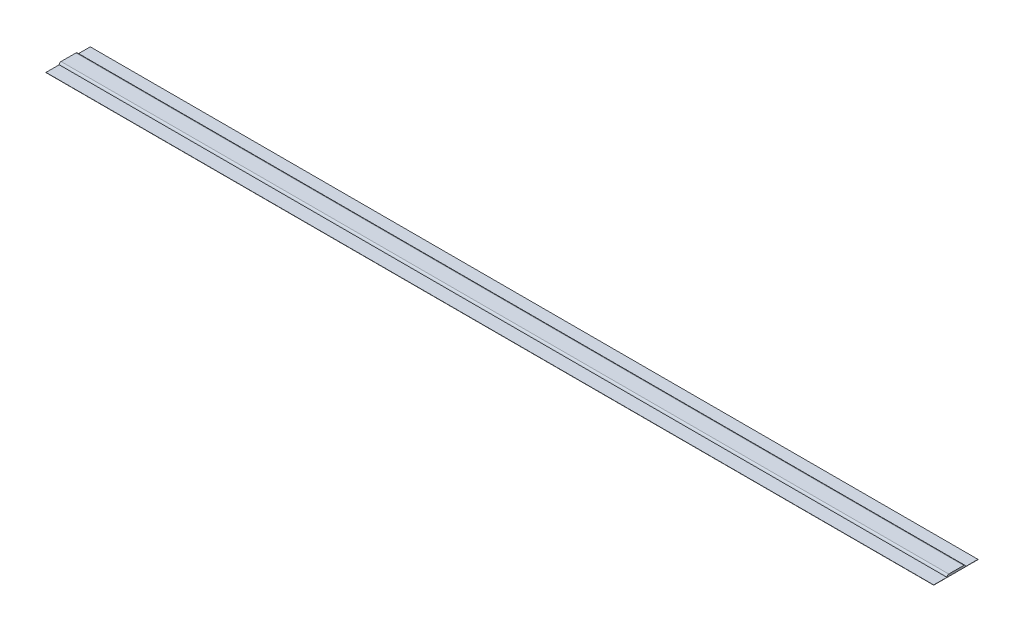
from build123d import *

# Parameters (mm, degrees)
SKETCH1_W           = 954.786
SKETCH1_H           = 47.625
BOSS_EXTRUDE1_DEPTH = 0.254
BOSS_EXTRUDE2_DEPTH = 954.786


with BuildPart() as part:
    # Sketch1 → Boss-Extrude1 (new body)
    with BuildSketch(Plane(origin=(0, 0, 0), x_dir=(1, 0, 0), z_dir=(0, 1, 0))):
        Rectangle(SKETCH1_W, SKETCH1_H)
    extrude(amount=BOSS_EXTRUDE1_DEPTH)

    # Sketch2 → Boss-Extrude2 (add, through all)
    with BuildSketch(Plane(origin=(477.393, 0, 0), x_dir=(0, 0, -1), z_dir=(1, 0, 0))):
        with BuildLine():
            Line((8.380000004, 2.286), (-7.62, 2.286))
            ThreePointArc((-7.62, 2.286), (-9.056840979, 1.690840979), (-9.652, 0.254))
            Line((-9.652, 0.254), (10.412000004, 0.254))
            ThreePointArc((10.412000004, 0.254), (9.816840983, 1.690840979), (8.380000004, 2.286))
        make_face()
    extrude(amount=-BOSS_EXTRUDE2_DEPTH)


solid = part.part
